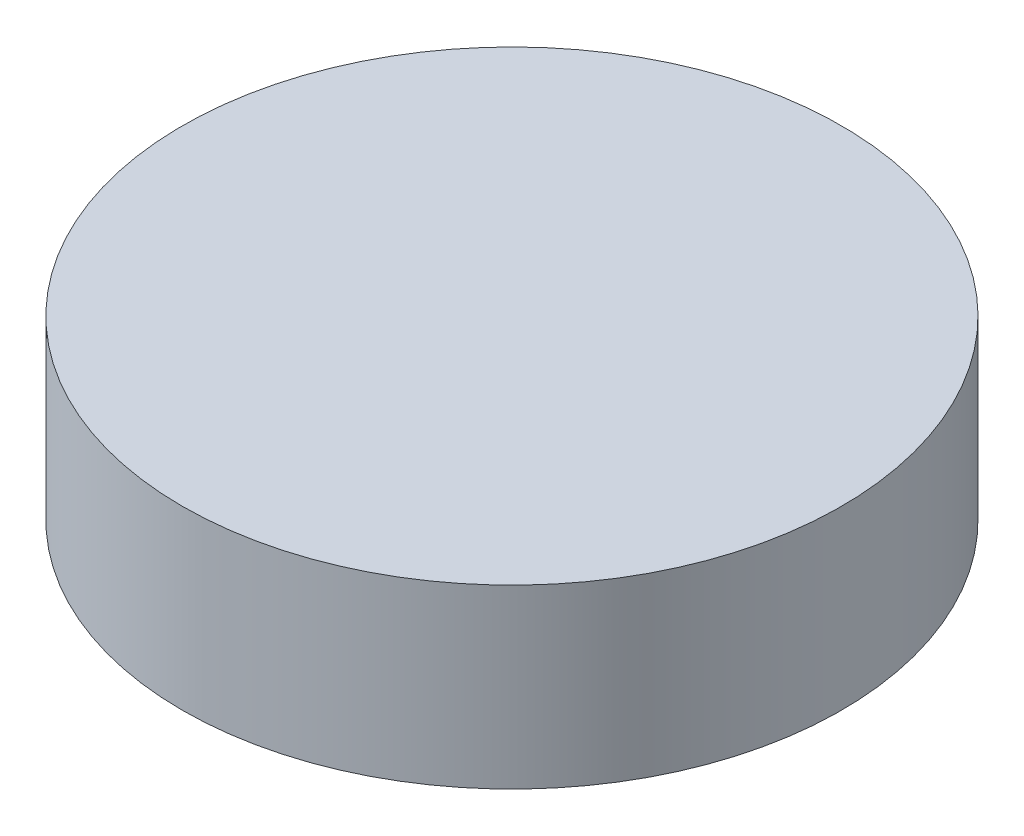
from build123d import *

# Parameters (mm, degrees)
SKETCH1_R           = 3.175
BOSS_EXTRUDE1_DEPTH = 1.7018


with BuildPart() as part:
    # Sketch1 → Boss-Extrude1 (new body)
    with BuildSketch(Plane(origin=(0, 0, 0), x_dir=(1, 0, 0), z_dir=(0, 1, 0))):
        with Locations(Location((0, 0, 0), (0, 0, 270))):
            Circle(SKETCH1_R)
    extrude(amount=BOSS_EXTRUDE1_DEPTH)


solid = part.part
